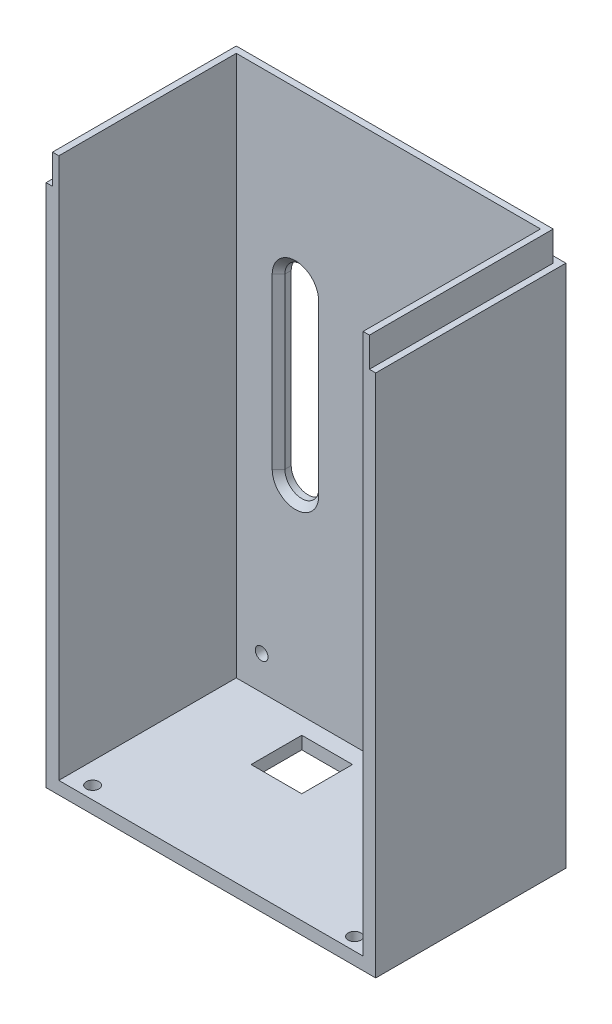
from build123d import *

# Parameters (mm, degrees)
SKETCH2_W           = 78
SKETCH2_H           = 256
BOSS_EXTRUDE1_DEPTH = 3
SKETCH3_W           = 78
SKETCH3_H           = 256
SKETCH3_W_2         = 72
SKETCH3_H_2         = 250
BOSS_EXTRUDE2_DEPTH = 42
SKETCH4_W           = 12
SKETCH4_H           = 12
SKETCH4_W_2         = 9.5
SKETCH4_H_2         = 11
CUT_EXTRUDE3_DEPTH  = 7
SKETCH6_W           = 11
SKETCH6_H           = 15
CUT_EXTRUDE4_DEPTH  = 6
SKETCH9_R           = 1.5
CUT_EXTRUDE6_DEPTH  = 263.834548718
CUT_EXTRUDE8_DEPTH  = 142.173651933
SKETCH16_R          = 1.5
CUT_EXTRUDE9_DEPTH  = 142.173651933
SKETCH19_W          = 37
SKETCH19_H          = 28
CUT_EXTRUDE11_DEPTH = 15
SKETCH25_W          = 7
SKETCH25_H          = 20
CUT_EXTRUDE16_DEPTH = 4
SKETCH27_R          = 1.5
CUT_EXTRUDE17_DEPTH = 10
CUT_EXTRUDE18_DEPTH = 141.24621207
SKETCH30_W          = 78
SKETCH30_H          = 125
CUT_EXTRUDE19_DEPTH = 141.24621207
SKETCH31_W          = 1.5
SKETCH31_H          = 7
CUT_EXTRUDE20_DEPTH = 141.24621207
CUT_EXTRUDE24_DEPTH = 7
CHAMFER1_SIZE       = 1.5
CHAMFER2_SIZE       = 1.5


with BuildPart() as part:
    # Sketch2 → Boss-Extrude1 (new body)
    with BuildSketch(Plane.XY):
        Rectangle(SKETCH2_W, SKETCH2_H)
    extrude(amount=BOSS_EXTRUDE1_DEPTH)

    # Sketch3 → Boss-Extrude2 (add)
    with BuildSketch(Plane.XY.offset(3)):
        Rectangle(SKETCH3_W, SKETCH3_H)
        Rectangle(SKETCH3_W_2, SKETCH3_H_2, mode=Mode.SUBTRACT)
    extrude(amount=BOSS_EXTRUDE2_DEPTH)

    # Sketch4 → Cut-Extrude3 (cut)
    with BuildSketch(Plane.XZ.offset(128)):
        with Locations((-10.5, 13)):
            Rectangle(SKETCH4_W, SKETCH4_H)
        with Locations((19.25, 12.5)):
            Rectangle(SKETCH4_W_2, SKETCH4_H_2)
    extrude(amount=-CUT_EXTRUDE3_DEPTH, mode=Mode.SUBTRACT)

    # Sketch6 → Cut-Extrude4 (cut)
    with BuildSketch(Plane.ZY.offset(39)):
        with Locations((11.5, 60.5)):
            Rectangle(SKETCH6_W, SKETCH6_H)
    extrude(amount=-CUT_EXTRUDE4_DEPTH, mode=Mode.SUBTRACT)

    # Sketch9 → Cut-Extrude6 (cut, through all)
    with BuildSketch(Plane.XZ.offset(128)):
        with Locations(Location((-31, 42, 0), (0, 0, 270))):
            Circle(SKETCH9_R)
        with Locations(Location((31, 42, 0), (0, 0, 270))):
            Circle(SKETCH9_R)
    extrude(amount=-CUT_EXTRUDE6_DEPTH, mode=Mode.SUBTRACT)

    # Sketch14 → Cut-Extrude8 (cut, through all)
    with BuildSketch(Plane(origin=(0, 0, 0), x_dir=(-1, 0, 0), z_dir=(0, 0, -1))):
        with BuildLine():
            Line((26, 99.112167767), (26, 59.112167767))
            ThreePointArc((26, 59.112167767), (22, 55.112167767), (18, 59.112167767))
            Line((18, 59.112167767), (18, 99.112167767))
            ThreePointArc((18, 99.112167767), (22, 103.112167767), (26, 99.112167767))
        make_face()
        with BuildLine():
            Line((-18, 99.112167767), (-18, 59.112167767))
            ThreePointArc((-18, 59.112167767), (-22, 55.112167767), (-26, 59.112167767))
            Line((-26, 59.112167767), (-26, 99.112167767))
            ThreePointArc((-26, 99.112167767), (-22, 103.112167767), (-18, 99.112167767))
        make_face()
        with BuildLine():
            Line((26, -38), (26, -78))
            ThreePointArc((26, -78), (22, -82), (18, -78))
            Line((18, -78), (18, -38))
            ThreePointArc((18, -38), (22, -34), (26, -38))
        make_face()
        with BuildLine():
            Line((-18, -38), (-18, -78))
            ThreePointArc((-18, -78), (-22, -82), (-26, -78))
            Line((-26, -78), (-26, -38))
            ThreePointArc((-26, -38), (-22, -34), (-18, -38))
        make_face()
    extrude(amount=-CUT_EXTRUDE8_DEPTH, mode=Mode.SUBTRACT)

    # Sketch16 → Cut-Extrude9 (cut, through all)
    with BuildSketch(Plane(origin=(0, 0, 0), x_dir=(-1, 0, 0), z_dir=(0, 0, -1))):
        with Locations((30, 117)):
            Circle(SKETCH16_R)
        with Locations((-30, 117)):
            Circle(SKETCH16_R)
        with Locations((30, -117)):
            Circle(SKETCH16_R)
        with Locations((-30, -117)):
            Circle(SKETCH16_R)
    extrude(amount=-CUT_EXTRUDE9_DEPTH, mode=Mode.SUBTRACT)

    # Sketch19 → Cut-Extrude11 (cut)
    with BuildSketch(Plane(origin=(0, 128, 0), x_dir=(1, 0, 0), z_dir=(0, 1, 0))):
        with Locations((0.5, -21)):
            Rectangle(SKETCH19_W, SKETCH19_H)
    extrude(amount=-CUT_EXTRUDE11_DEPTH, mode=Mode.SUBTRACT)

    # Sketch25 → Cut-Extrude16 (cut)
    with BuildSketch(Plane(origin=(0, 128, 0), x_dir=(1, 0, 0), z_dir=(0, 1, 0))):
        with Locations((-31.5, -25)):
            Rectangle(SKETCH25_W, SKETCH25_H)
        with Locations((31.5, -25)):
            Rectangle(SKETCH25_W, SKETCH25_H)
    extrude(amount=-CUT_EXTRUDE16_DEPTH, mode=Mode.SUBTRACT)

    # Sketch27 → Cut-Extrude17 (cut)
    with BuildSketch(Plane(origin=(0, 128, 0), x_dir=(1, 0, 0), z_dir=(0, 1, 0))):
        with Locations(Location((-21.504408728, -8, 0), (0, 0, 270))):
            Circle(SKETCH27_R)
        with Locations(Location((24.504408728, -8, 0), (0, 0, 270))):
            Circle(SKETCH27_R)
        with Locations(Location((-21.504408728, -35, 0), (0, 0, 270))):
            Circle(SKETCH27_R)
        with Locations(Location((24.504408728, -35, 0), (0, 0, 270))):
            Circle(SKETCH27_R)
    extrude(amount=-CUT_EXTRUDE17_DEPTH, mode=Mode.SUBTRACT)

    # Sketch29 → Cut-Extrude18 (cut, through all)
    with BuildSketch(Plane.XY.offset(3)):
        Polygon((-39, 128), (39, 128), (39, 3), (36, 3), (-39, 3), align=None)
    extrude(amount=CUT_EXTRUDE18_DEPTH, mode=Mode.SUBTRACT)

    # Sketch30 → Cut-Extrude19 (cut, through all)
    with BuildSketch(Plane.XY.offset(3)):
        with Locations((0, 65.5)):
            Rectangle(SKETCH30_W, SKETCH30_H)
    extrude(amount=-CUT_EXTRUDE19_DEPTH, mode=Mode.SUBTRACT)

    # Sketch31 → Cut-Extrude20 (cut, through all)
    with BuildSketch(Plane.XY.offset(3)):
        with Locations((-38.25, -0.5)):
            Rectangle(SKETCH31_W, SKETCH31_H)
        with Locations((38.25, -0.5)):
            Rectangle(SKETCH31_W, SKETCH31_H)
    extrude(amount=CUT_EXTRUDE20_DEPTH, mode=Mode.SUBTRACT)

    # Sketch34 → Cut-Extrude24 (cut)
    with BuildSketch(Plane(origin=(0, 3, 0), x_dir=(1, 0, 0), z_dir=(0, 1, 0))):
        Polygon((39, 0), (-39, 0), (-39, -1.5), (-39, -3), (-37.5, -3), (-37.5, -1.5), (37.5, -1.5), (37.5, -3), (39, -3), (39, -1.5), align=None)
    extrude(amount=-CUT_EXTRUDE24_DEPTH, mode=Mode.SUBTRACT)

    # Chamfer1
    chamfer1_edges = [part.edges().sort_by_distance(p)[0] for p in [
        (-18, -58, 3),
        (-22, -82, 3),
        (-26, -58, 3),
        (-22, -34, 3),
    ]]
    chamfer(chamfer1_edges, length=CHAMFER1_SIZE)

    # Chamfer2
    chamfer2_edges = [part.edges().sort_by_distance(p)[0] for p in [
        (22, -34, 0),
        (26, -58, 0),
        (22, -82, 0),
        (18, -58, 0),
    ]]
    chamfer(chamfer2_edges, length=CHAMFER2_SIZE)


solid = part.part
